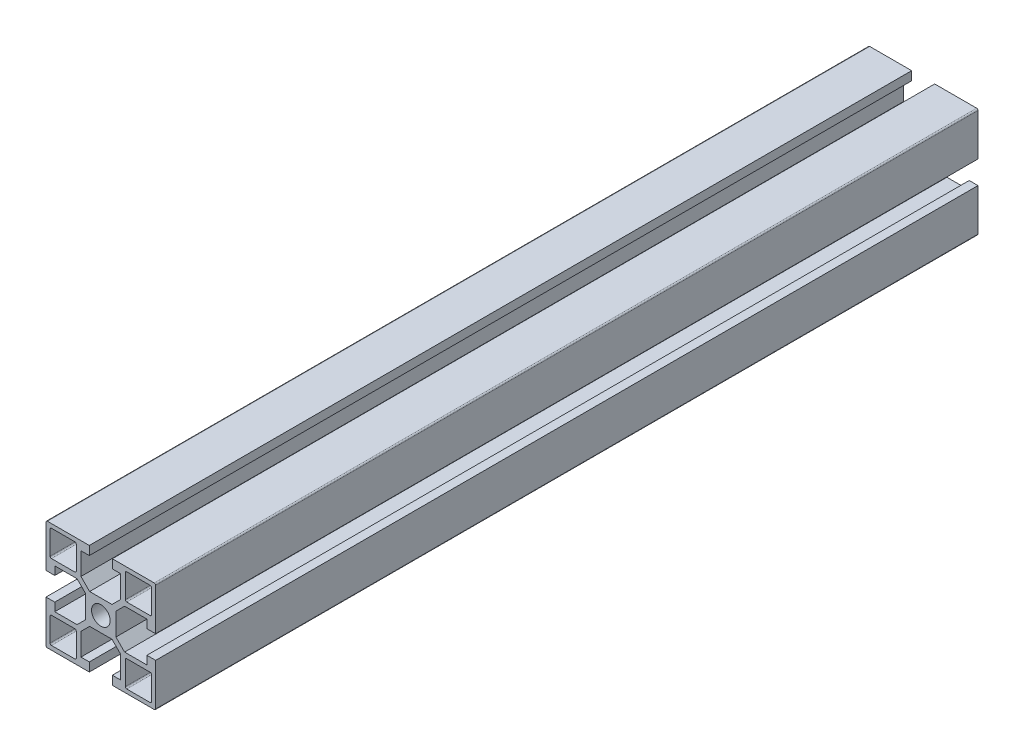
from build123d import *

# Parameters (mm, degrees)
SKETCH_1_R      = 3.4
EXTRUDE_1_DEPTH = 150


with BuildPart() as part:
    # Sketch 1 → Extrude 1 (new, symmetric)
    with BuildSketch(Plane.XY):
        with BuildLine():
            Line((20, -4.2), (16.8, -4.2))
            Line((16.8, -4.2), (16.8, -7.25))
            Line((16.8, -7.25), (8.664213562, -7.25))
            Line((8.664213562, -7.25), (5.5, -4.085786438))
            Line((5.5, -4.085786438), (5.5, 0))
            Line((5.5, 0), (5.5, 4.085786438))
            Line((5.5, 4.085786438), (8.664213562, 7.25))
            Line((8.664213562, 7.25), (16.8, 7.25))
            Line((16.8, 7.25), (16.8, 4.2))
            Line((16.8, 4.2), (20, 4.2))
            Line((20, 4.2), (20, 19.5))
            ThreePointArc((20, 19.5), (19.853553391, 19.853553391), (19.5, 20))
            Line((19.5, 20), (4.2, 20))
            Line((4.2, 20), (4.2, 16.8))
            Line((4.2, 16.8), (7.25, 16.8))
            Line((7.25, 16.8), (7.25, 8.664213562))
            Line((7.25, 8.664213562), (4.085786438, 5.5))
            Line((4.085786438, 5.5), (0, 5.5))
            Line((0, 5.5), (-4.085786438, 5.5))
            Line((-4.085786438, 5.5), (-7.25, 8.664213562))
            Line((-7.25, 8.664213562), (-7.25, 16.8))
            Line((-7.25, 16.8), (-4.2, 16.8))
            Line((-4.2, 16.8), (-4.2, 20))
            Line((-4.2, 20), (-19.5, 20))
            ThreePointArc((-19.5, 20), (-19.853553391, 19.853553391), (-20, 19.5))
            Line((-20, 19.5), (-20, 4.2))
            Line((-20, 4.2), (-16.8, 4.2))
            Line((-16.8, 4.2), (-16.8, 7.25))
            Line((-16.8, 7.25), (-8.664213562, 7.25))
            Line((-8.664213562, 7.25), (-5.5, 4.085786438))
            Line((-5.5, 4.085786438), (-5.5, 0))
            Line((-5.5, 0), (-5.5, -4.085786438))
            Line((-5.5, -4.085786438), (-8.664213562, -7.25))
            Line((-8.664213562, -7.25), (-16.8, -7.25))
            Line((-16.8, -7.25), (-16.8, -4.2))
            Line((-16.8, -4.2), (-20, -4.2))
            Line((-20, -4.2), (-20, -19.5))
            ThreePointArc((-20, -19.5), (-19.853553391, -19.853553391), (-19.5, -20))
            Line((-19.5, -20), (-4.2, -20))
            Line((-4.2, -20), (-4.2, -16.8))
            Line((-4.2, -16.8), (-7.25, -16.8))
            Line((-7.25, -16.8), (-7.25, -8.664213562))
            Line((-7.25, -8.664213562), (-4.085786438, -5.5))
            Line((-4.085786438, -5.5), (0, -5.5))
            Line((0, -5.5), (4.085786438, -5.5))
            Line((4.085786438, -5.5), (7.25, -8.664213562))
            Line((7.25, -8.664213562), (7.25, -16.8))
            Line((7.25, -16.8), (4.2, -16.8))
            Line((4.2, -16.8), (4.2, -20))
            Line((4.2, -20), (19.5, -20))
            ThreePointArc((19.5, -20), (19.853553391, -19.853553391), (20, -19.5))
            Line((20, -19.5), (20, -4.2))
        make_face()
        Circle(SKETCH_1_R, mode=Mode.SUBTRACT)
        with BuildLine():
            Line((-9.450621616, 18.526919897), (-18, 18.526919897))
            ThreePointArc((-18, 18.526919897), (-18.353553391, 18.380473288), (-18.5, 18.026919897))
            Line((-18.5, 18.026919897), (-18.5, 9.454086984))
            ThreePointArc((-18.5, 9.454086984), (-18.353553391, 9.100533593), (-18, 8.954086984))
            Line((-18, 8.954086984), (-9.450621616, 8.954086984))
            ThreePointArc((-9.450621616, 8.954086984), (-9.097068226, 9.100533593), (-8.950621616, 9.454086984))
            Line((-8.950621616, 9.454086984), (-8.950621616, 18.026919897))
            ThreePointArc((-8.950621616, 18.026919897), (-9.097068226, 18.380473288), (-9.450621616, 18.526919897))
        make_face(mode=Mode.SUBTRACT)
        with BuildLine():
            Line((-18.526919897, -9.450621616), (-18.526919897, -18))
            ThreePointArc((-18.526919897, -18), (-18.380473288, -18.353553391), (-18.026919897, -18.5))
            Line((-18.026919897, -18.5), (-9.454086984, -18.5))
            ThreePointArc((-9.454086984, -18.5), (-9.100533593, -18.353553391), (-8.954086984, -18))
            Line((-8.954086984, -18), (-8.954086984, -9.450621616))
            ThreePointArc((-8.954086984, -9.450621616), (-9.100533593, -9.097068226), (-9.454086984, -8.950621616))
            Line((-9.454086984, -8.950621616), (-18.026919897, -8.950621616))
            ThreePointArc((-18.026919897, -8.950621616), (-18.380473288, -9.097068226), (-18.526919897, -9.450621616))
        make_face(mode=Mode.SUBTRACT)
        with BuildLine():
            Line((9.450621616, -18.526919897), (18, -18.526919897))
            ThreePointArc((18, -18.526919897), (18.353553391, -18.380473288), (18.5, -18.026919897))
            Line((18.5, -18.026919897), (18.5, -9.454086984))
            ThreePointArc((18.5, -9.454086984), (18.353553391, -9.100533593), (18, -8.954086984))
            Line((18, -8.954086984), (9.450621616, -8.954086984))
            ThreePointArc((9.450621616, -8.954086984), (9.097068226, -9.100533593), (8.950621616, -9.454086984))
            Line((8.950621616, -9.454086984), (8.950621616, -18.026919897))
            ThreePointArc((8.950621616, -18.026919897), (9.097068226, -18.380473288), (9.450621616, -18.526919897))
        make_face(mode=Mode.SUBTRACT)
        with BuildLine():
            Line((18.526919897, 9.450621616), (18.526919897, 18))
            ThreePointArc((18.526919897, 18), (18.380473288, 18.353553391), (18.026919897, 18.5))
            Line((18.026919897, 18.5), (9.454086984, 18.5))
            ThreePointArc((9.454086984, 18.5), (9.100533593, 18.353553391), (8.954086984, 18))
            Line((8.954086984, 18), (8.954086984, 9.450621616))
            ThreePointArc((8.954086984, 9.450621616), (9.100533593, 9.097068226), (9.454086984, 8.950621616))
            Line((9.454086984, 8.950621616), (18.026919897, 8.950621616))
            ThreePointArc((18.026919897, 8.950621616), (18.380473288, 9.097068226), (18.526919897, 9.450621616))
        make_face(mode=Mode.SUBTRACT)
    extrude(amount=EXTRUDE_1_DEPTH, both=True)


solid = part.part
